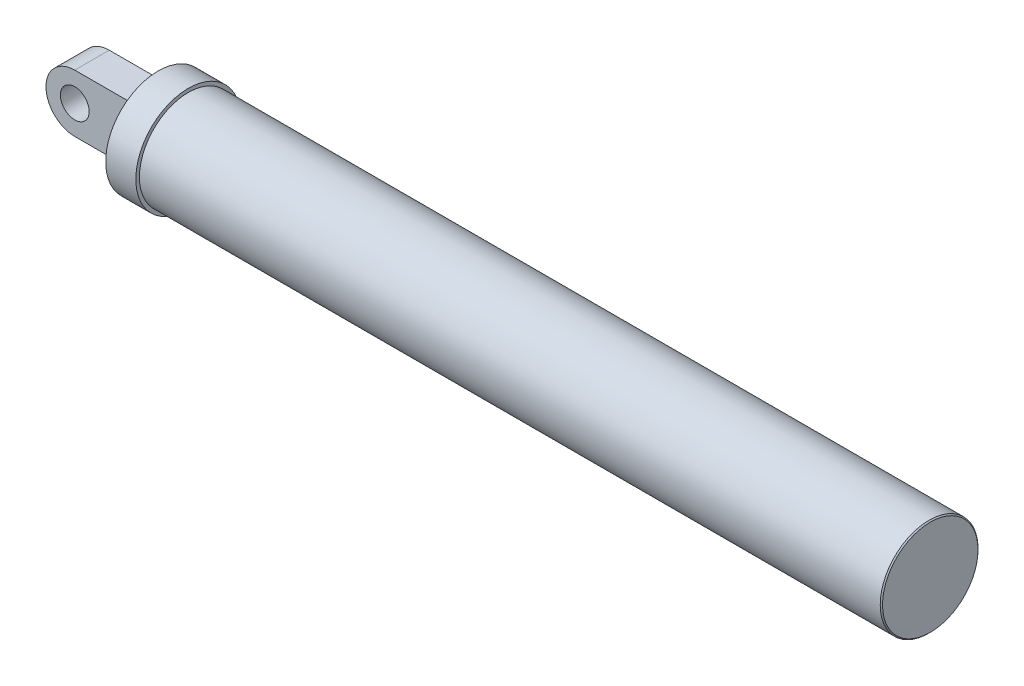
from build123d import *

# Parameters (mm, degrees)
ESQUISSE1_R      = 91.25
EXTRUSION1_DEPTH = 52.4
ESQUISSE2_R      = 85
EXTRUSION2_DEPTH = 1290
CHANFREIN1_SIZE  = 2
ESQUISSE5_R      = 25
EXTRUSION3_DEPTH = 30


with BuildPart() as part:
    # Esquisse1 → Extrusion1 (new body)
    with BuildSketch(Plane(origin=(0, 0, 0), x_dir=(0, 0, -1), z_dir=(1, 0, 0))):
        Circle(ESQUISSE1_R)
    extrude(amount=EXTRUSION1_DEPTH)

    # Esquisse2 → Extrusion2 (add)
    with BuildSketch(Plane(origin=(52.4, 0, 0), x_dir=(0, 0, -1), z_dir=(1, 0, 0))):
        with Locations(Location((0, 0, 0), (0, 0, 180))):
            Circle(ESQUISSE2_R)
    extrude(amount=EXTRUSION2_DEPTH)

    # Chanfrein1
    chanfrein1_edges = [part.edges().sort_by_distance(p)[0] for p in [
        (1342.4, 0, -85),
    ]]
    chamfer(chanfrein1_edges, length=CHANFREIN1_SIZE)

    # Esquisse3 → Enl_vement de mati_re-R_volution1 (revolve, cut)
    with BuildSketch(Plane.XY, mode=Mode.PRIVATE) as enl_vement_de_mati_re_r_volution1_sk:
        Polygon((926.000813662, 65.3), (1218.4, 65.3), (1218.4, 70), (12.594294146, 70), (12.594294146, 0), (926.000813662, 0), align=None)
    revolve(enl_vement_de_mati_re_r_volution1_sk.sketch.rotate(Axis((0, 0, 0), (1, 0, 0)), 90), axis=Axis((0, 0, 0), (1, 0, 0)), mode=Mode.SUBTRACT)

    # Esquisse5 → Extrusion3 (add, symmetric)
    with BuildSketch(Plane.XY):
        with BuildLine():
            Line((-115, 50), (0, 50))
            Line((0, 50), (0, -50))
            Line((0, -50), (-115, -50))
            ThreePointArc((-115, -50), (-165, 0), (-115, 50))
        make_face()
        with Locations((-115, 0)):
            Circle(ESQUISSE5_R, mode=Mode.SUBTRACT)
    extrude(amount=EXTRUSION3_DEPTH, both=True)


solid = part.part
